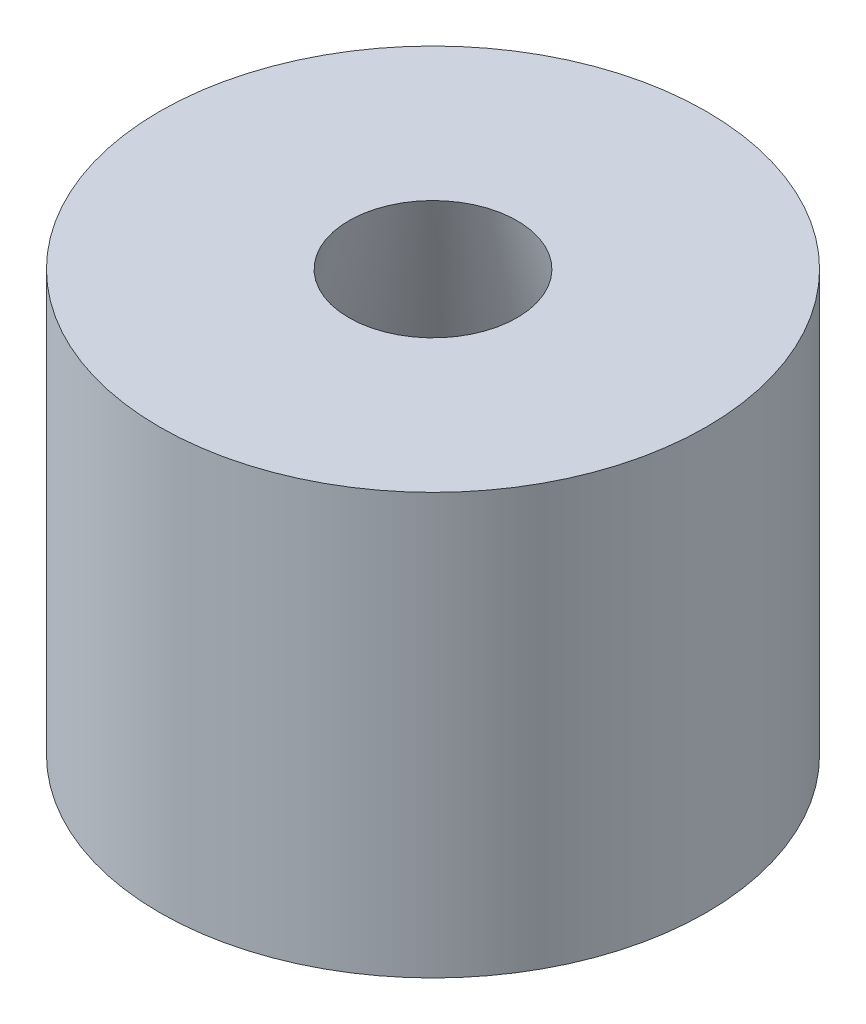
from build123d import *


with BuildPart() as part:
    # Sketch1 → Base-Revolve (revolve)
    with BuildSketch(Plane.XY, mode=Mode.PRIVATE) as base_revolve_sk:
        Polygon((12.7, 0), (41.275, 0), (41.275, -63.5), (31.75, -63.5), align=None)
    revolve(base_revolve_sk.sketch.rotate(Axis((0, 44.950788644, 0), (0, -1, 0)), 90), axis=Axis((0, 44.950788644, 0), (0, -1, 0)))


solid = part.part
